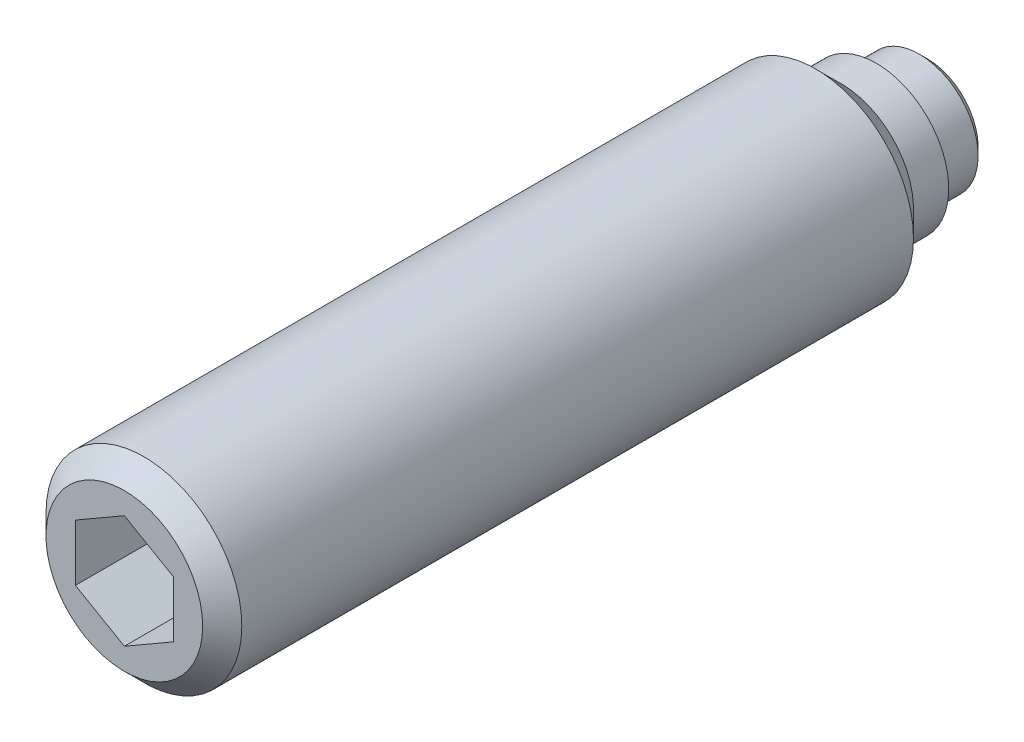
ISO-10303-21;
HEADER;
FILE_DESCRIPTION(('STEP AP214'),'2;1');
FILE_NAME('part.step','',(''),(''),'','','');
FILE_SCHEMA(('AUTOMOTIVE_DESIGN { 1 0 10303 214 1 1 1 1 }'));
ENDSEC;
DATA;
#1=APPLICATION_CONTEXT('core data for automotive mechanical design processes');
#2=APPLICATION_PROTOCOL_DEFINITION('international standard','automotive_design',2000,#1);
#3=PRODUCT_CONTEXT('',#1,'mechanical');
#4=PRODUCT('Part','Part','',(#3));
#5=PRODUCT_RELATED_PRODUCT_CATEGORY('part','',(#4));
#6=PRODUCT_DEFINITION_FORMATION('','',#4);
#7=PRODUCT_DEFINITION_CONTEXT('part definition',#1,'design');
#8=PRODUCT_DEFINITION('design','',#6,#7);
#9=PRODUCT_DEFINITION_SHAPE('','',#8);
#10=(LENGTH_UNIT() NAMED_UNIT(*) SI_UNIT(.MILLI.,.METRE.));
#11=(NAMED_UNIT(*) PLANE_ANGLE_UNIT() SI_UNIT($,.RADIAN.));
#12=(NAMED_UNIT(*) SI_UNIT($,.STERADIAN.) SOLID_ANGLE_UNIT());
#13=UNCERTAINTY_MEASURE_WITH_UNIT(LENGTH_MEASURE(1.E-05),#10,'distance_accuracy_value','');
#14=(GEOMETRIC_REPRESENTATION_CONTEXT(3) GLOBAL_UNCERTAINTY_ASSIGNED_CONTEXT((#13)) GLOBAL_UNIT_ASSIGNED_CONTEXT((#10,
#11,#12)) REPRESENTATION_CONTEXT('',''));
#15=CARTESIAN_POINT('',(0.,0.,0.));
#16=DIRECTION('',(0.,0.,1.));
#17=DIRECTION('',(1.,0.,0.));
#18=AXIS2_PLACEMENT_3D('',#15,#16,#17);
#19=CARTESIAN_POINT('',(0.,0.,1.3));
#20=DIRECTION('',(0.,0.,-1.));
#21=DIRECTION('',(-1.,0.,0.));
#22=AXIS2_PLACEMENT_3D('',#19,#20,#21);
#23=CYLINDRICAL_SURFACE('',#22,2.5);
#24=CARTESIAN_POINT('',(0.,0.,2.85));
#25=DIRECTION('',(0.,0.,-1.));
#26=DIRECTION('',(-1.,0.,0.));
#27=AXIS2_PLACEMENT_3D('',#24,#25,#26);
#28=CIRCLE('',#27,2.5);
#29=CARTESIAN_POINT('',(-2.5,0.,2.85));
#30=VERTEX_POINT('',#29);
#31=EDGE_CURVE('E9',#30,#30,#28,.T.);
#32=ORIENTED_EDGE('',*,*,#31,.F.);
#33=EDGE_LOOP('',(#32));
#34=FACE_BOUND('',#33,.T.);
#35=CARTESIAN_POINT('',(0.,0.,20.));
#36=DIRECTION('',(0.,0.,1.));
#37=DIRECTION('',(1.,0.,0.));
#38=AXIS2_PLACEMENT_3D('',#35,#36,#37);
#39=CIRCLE('',#38,2.5);
#40=CARTESIAN_POINT('',(2.5,0.,20.));
#41=VERTEX_POINT('',#40);
#42=EDGE_CURVE('E115',#41,#41,#39,.T.);
#43=ORIENTED_EDGE('',*,*,#42,.F.);
#44=EDGE_LOOP('',(#43));
#45=FACE_BOUND('',#44,.T.);
#46=ADVANCED_FACE('F14',(#34,#45),#23,.T.);
#47=CARTESIAN_POINT('',(0.,0.,2.85));
#48=DIRECTION('',(0.,0.,1.));
#49=DIRECTION('',(1.,0.,0.));
#50=AXIS2_PLACEMENT_3D('',#47,#48,#49);
#51=CONICAL_SURFACE('',#50,2.5,0.785398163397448);
#52=ORIENTED_EDGE('',*,*,#31,.T.);
#53=EDGE_LOOP('',(#52));
#54=FACE_BOUND('',#53,.T.);
#55=CARTESIAN_POINT('',(0.,0.,2.2));
#56=DIRECTION('',(0.,0.,-1.));
#57=DIRECTION('',(-1.,0.,0.));
#58=AXIS2_PLACEMENT_3D('',#55,#56,#57);
#59=CIRCLE('',#58,1.85);
#60=CARTESIAN_POINT('',(-1.85,0.,2.2));
#61=VERTEX_POINT('',#60);
#62=EDGE_CURVE('E21',#61,#61,#59,.T.);
#63=ORIENTED_EDGE('',*,*,#62,.F.);
#64=EDGE_LOOP('',(#63));
#65=FACE_BOUND('',#64,.T.);
#66=ADVANCED_FACE('F143',(#54,#65),#51,.T.);
#67=CARTESIAN_POINT('',(0.,0.,1.3));
#68=DIRECTION('',(0.,0.,-1.));
#69=DIRECTION('',(-1.,0.,0.));
#70=AXIS2_PLACEMENT_3D('',#67,#68,#69);
#71=CYLINDRICAL_SURFACE('',#70,1.85);
#72=ORIENTED_EDGE('',*,*,#62,.T.);
#73=EDGE_LOOP('',(#72));
#74=FACE_BOUND('',#73,.T.);
#75=CARTESIAN_POINT('',(0.,0.,1.3));
#76=DIRECTION('',(0.,0.,-1.));
#77=DIRECTION('',(-1.,0.,0.));
#78=AXIS2_PLACEMENT_3D('',#75,#76,#77);
#79=CIRCLE('',#78,1.85);
#80=CARTESIAN_POINT('',(-1.85,0.,1.3));
#81=VERTEX_POINT('',#80);
#82=EDGE_CURVE('E135',#81,#81,#79,.T.);
#83=ORIENTED_EDGE('',*,*,#82,.F.);
#84=EDGE_LOOP('',(#83));
#85=FACE_BOUND('',#84,.T.);
#86=ADVANCED_FACE('F140',(#74,#85),#71,.T.);
#87=CARTESIAN_POINT('',(0.,1.85,1.3));
#88=DIRECTION('',(0.,0.,1.));
#89=DIRECTION('',(1.,0.,0.));
#90=AXIS2_PLACEMENT_3D('',#87,#88,#89);
#91=PLANE('',#90);
#92=ORIENTED_EDGE('',*,*,#82,.T.);
#93=EDGE_LOOP('',(#92));
#94=FACE_BOUND('',#93,.T.);
#95=CARTESIAN_POINT('',(0.,0.,1.3));
#96=DIRECTION('',(0.,0.,-1.));
#97=DIRECTION('',(-1.,0.,0.));
#98=AXIS2_PLACEMENT_3D('',#95,#96,#97);
#99=CIRCLE('',#98,1.5);
#100=CARTESIAN_POINT('',(-1.5,0.,1.3));
#101=VERTEX_POINT('',#100);
#102=EDGE_CURVE('E132',#101,#101,#99,.T.);
#103=ORIENTED_EDGE('',*,*,#102,.F.);
#104=EDGE_LOOP('',(#103));
#105=FACE_BOUND('',#104,.T.);
#106=ADVANCED_FACE('F151',(#94,#105),#91,.F.);
#107=CARTESIAN_POINT('',(0.,0.,0.));
#108=DIRECTION('',(0.,0.,-1.));
#109=DIRECTION('',(-1.,0.,0.));
#110=AXIS2_PLACEMENT_3D('',#107,#108,#109);
#111=CYLINDRICAL_SURFACE('',#110,1.5);
#112=CARTESIAN_POINT('',(0.,0.,0.2));
#113=DIRECTION('',(0.,0.,-1.));
#114=DIRECTION('',(-1.,0.,0.));
#115=AXIS2_PLACEMENT_3D('',#112,#113,#114);
#116=CIRCLE('',#115,1.5);
#117=CARTESIAN_POINT('',(-1.5,0.,0.2));
#118=VERTEX_POINT('',#117);
#119=EDGE_CURVE('E129',#118,#118,#116,.T.);
#120=ORIENTED_EDGE('',*,*,#119,.F.);
#121=EDGE_LOOP('',(#120));
#122=FACE_BOUND('',#121,.T.);
#123=ORIENTED_EDGE('',*,*,#102,.T.);
#124=EDGE_LOOP('',(#123));
#125=FACE_BOUND('',#124,.T.);
#126=ADVANCED_FACE('F157',(#122,#125),#111,.T.);
#127=CARTESIAN_POINT('',(0.,0.,0.2));
#128=DIRECTION('',(0.,0.,1.));
#129=DIRECTION('',(1.,0.,0.));
#130=AXIS2_PLACEMENT_3D('',#127,#128,#129);
#131=CONICAL_SURFACE('',#130,1.5,0.785398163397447);
#132=CARTESIAN_POINT('',(0.,0.,0.));
#133=DIRECTION('',(0.,0.,-1.));
#134=DIRECTION('',(-1.,0.,0.));
#135=AXIS2_PLACEMENT_3D('',#132,#133,#134);
#136=CIRCLE('',#135,1.3);
#137=CARTESIAN_POINT('',(-1.3,0.,0.));
#138=VERTEX_POINT('',#137);
#139=EDGE_CURVE('E126',#138,#138,#136,.T.);
#140=ORIENTED_EDGE('',*,*,#139,.F.);
#141=EDGE_LOOP('',(#140));
#142=FACE_BOUND('',#141,.T.);
#143=ORIENTED_EDGE('',*,*,#119,.T.);
#144=EDGE_LOOP('',(#143));
#145=FACE_BOUND('',#144,.T.);
#146=ADVANCED_FACE('F161',(#142,#145),#131,.T.);
#147=CARTESIAN_POINT('',(0.,1.3,0.));
#148=DIRECTION('',(0.,0.,1.));
#149=DIRECTION('',(1.,0.,0.));
#150=AXIS2_PLACEMENT_3D('',#147,#148,#149);
#151=PLANE('',#150);
#152=ORIENTED_EDGE('',*,*,#139,.T.);
#153=EDGE_LOOP('',(#152));
#154=FACE_BOUND('',#153,.T.);
#155=ADVANCED_FACE('F165',(#154),#151,.F.);
#156=CARTESIAN_POINT('',(0.,0.,20.5));
#157=DIRECTION('',(0.,0.,1.));
#158=DIRECTION('',(1.,0.,0.));
#159=AXIS2_PLACEMENT_3D('',#156,#157,#158);
#160=PLANE('',#159);
#161=DIRECTION('',(0.866025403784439,-0.5,0.));
#162=VECTOR('',#161,1.);
#163=CARTESIAN_POINT('',(-1.25,-0.721687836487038,20.5));
#164=LINE('',#163,#162);
#165=CARTESIAN_POINT('',(-1.25,-0.721687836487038,20.5));
#166=VERTEX_POINT('',#165);
#167=CARTESIAN_POINT('',(0.,-1.44337567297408,20.5));
#168=VERTEX_POINT('',#167);
#169=EDGE_CURVE('E28',#166,#168,#164,.T.);
#170=ORIENTED_EDGE('',*,*,#169,.F.);
#171=DIRECTION('',(0.,-1.,0.));
#172=VECTOR('',#171,1.);
#173=CARTESIAN_POINT('',(-1.25,0.721687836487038,20.5));
#174=LINE('',#173,#172);
#175=CARTESIAN_POINT('',(-1.25,0.721687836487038,20.5));
#176=VERTEX_POINT('',#175);
#177=EDGE_CURVE('E111',#176,#166,#174,.T.);
#178=ORIENTED_EDGE('',*,*,#177,.F.);
#179=DIRECTION('',(-0.866025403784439,-0.5,0.));
#180=VECTOR('',#179,1.);
#181=CARTESIAN_POINT('',(0.,1.44337567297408,20.5));
#182=LINE('',#181,#180);
#183=CARTESIAN_POINT('',(0.,1.44337567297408,20.5));
#184=VERTEX_POINT('',#183);
#185=EDGE_CURVE('E109',#184,#176,#182,.T.);
#186=ORIENTED_EDGE('',*,*,#185,.F.);
#187=DIRECTION('',(-0.866025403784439,0.5,0.));
#188=VECTOR('',#187,1.);
#189=CARTESIAN_POINT('',(1.25,0.721687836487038,20.5));
#190=LINE('',#189,#188);
#191=CARTESIAN_POINT('',(1.25,0.721687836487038,20.5));
#192=VERTEX_POINT('',#191);
#193=EDGE_CURVE('E76',#192,#184,#190,.T.);
#194=ORIENTED_EDGE('',*,*,#193,.F.);
#195=DIRECTION('',(0.,1.,0.));
#196=VECTOR('',#195,1.);
#197=CARTESIAN_POINT('',(1.25,-0.721687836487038,20.5));
#198=LINE('',#197,#196);
#199=CARTESIAN_POINT('',(1.25,-0.721687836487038,20.5));
#200=VERTEX_POINT('',#199);
#201=EDGE_CURVE('E105',#200,#192,#198,.T.);
#202=ORIENTED_EDGE('',*,*,#201,.F.);
#203=DIRECTION('',(0.866025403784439,0.5,0.));
#204=VECTOR('',#203,1.);
#205=CARTESIAN_POINT('',(0.,-1.44337567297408,20.5));
#206=LINE('',#205,#204);
#207=EDGE_CURVE('E102',#168,#200,#206,.T.);
#208=ORIENTED_EDGE('',*,*,#207,.F.);
#209=EDGE_LOOP('',(#170,#178,#186,#194,#202,#208));
#210=FACE_BOUND('',#209,.T.);
#211=CARTESIAN_POINT('',(0.,0.,20.5));
#212=DIRECTION('',(0.,0.,1.));
#213=DIRECTION('',(1.,0.,0.));
#214=AXIS2_PLACEMENT_3D('',#211,#212,#213);
#215=CIRCLE('',#214,2.);
#216=CARTESIAN_POINT('',(2.,0.,20.5));
#217=VERTEX_POINT('',#216);
#218=EDGE_CURVE('E123',#217,#217,#215,.T.);
#219=ORIENTED_EDGE('',*,*,#218,.T.);
#220=EDGE_LOOP('',(#219));
#221=FACE_BOUND('',#220,.T.);
#222=ADVANCED_FACE('F169',(#210,#221),#160,.T.);
#223=CARTESIAN_POINT('',(0.,0.,20.5));
#224=DIRECTION('',(0.,0.,-1.));
#225=DIRECTION('',(-1.,0.,0.));
#226=AXIS2_PLACEMENT_3D('',#223,#224,#225);
#227=CONICAL_SURFACE('',#226,2.,0.785398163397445);
#228=ORIENTED_EDGE('',*,*,#42,.T.);
#229=EDGE_LOOP('',(#228));
#230=FACE_BOUND('',#229,.T.);
#231=ORIENTED_EDGE('',*,*,#218,.F.);
#232=EDGE_LOOP('',(#231));
#233=FACE_BOUND('',#232,.T.);
#234=ADVANCED_FACE('F173',(#230,#233),#227,.T.);
#235=CARTESIAN_POINT('',(-1.25,-0.721687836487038,17.5));
#236=DIRECTION('',(-0.5,-0.866025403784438,0.));
#237=DIRECTION('',(0.866025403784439,-0.5,0.));
#238=AXIS2_PLACEMENT_3D('',#235,#236,#237);
#239=PLANE('',#238);
#240=ORIENTED_EDGE('',*,*,#169,.T.);
#241=DIRECTION('',(0.,0.,1.));
#242=VECTOR('',#241,1.);
#243=CARTESIAN_POINT('',(0.,-1.44337567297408,17.5));
#244=LINE('',#243,#242);
#245=CARTESIAN_POINT('',(0.,-1.44337567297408,17.5));
#246=VERTEX_POINT('',#245);
#247=EDGE_CURVE('E58',#246,#168,#244,.T.);
#248=ORIENTED_EDGE('',*,*,#247,.F.);
#249=DIRECTION('',(0.866025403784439,-0.5,0.));
#250=VECTOR('',#249,1.);
#251=CARTESIAN_POINT('',(-1.25,-0.721687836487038,17.5));
#252=LINE('',#251,#250);
#253=CARTESIAN_POINT('',(-1.25,-0.721687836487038,17.5));
#254=VERTEX_POINT('',#253);
#255=EDGE_CURVE('E113',#254,#246,#252,.T.);
#256=ORIENTED_EDGE('',*,*,#255,.F.);
#257=DIRECTION('',(0.,0.,1.));
#258=VECTOR('',#257,1.);
#259=CARTESIAN_POINT('',(-1.25,-0.721687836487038,17.5));
#260=LINE('',#259,#258);
#261=EDGE_CURVE('E36',#254,#166,#260,.T.);
#262=ORIENTED_EDGE('',*,*,#261,.T.);
#263=EDGE_LOOP('',(#240,#248,#256,#262));
#264=FACE_BOUND('',#263,.T.);
#265=ADVANCED_FACE('F177',(#264),#239,.F.);
#266=CARTESIAN_POINT('',(-1.25,0.721687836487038,17.5));
#267=DIRECTION('',(-1.,0.,0.));
#268=DIRECTION('',(0.,0.,1.));
#269=AXIS2_PLACEMENT_3D('',#266,#267,#268);
#270=PLANE('',#269);
#271=ORIENTED_EDGE('',*,*,#177,.T.);
#272=ORIENTED_EDGE('',*,*,#261,.F.);
#273=DIRECTION('',(0.,-1.,0.));
#274=VECTOR('',#273,1.);
#275=CARTESIAN_POINT('',(-1.25,0.721687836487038,17.5));
#276=LINE('',#275,#274);
#277=CARTESIAN_POINT('',(-1.25,0.721687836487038,17.5));
#278=VERTEX_POINT('',#277);
#279=EDGE_CURVE('E88',#278,#254,#276,.T.);
#280=ORIENTED_EDGE('',*,*,#279,.F.);
#281=DIRECTION('',(0.,0.,1.));
#282=VECTOR('',#281,1.);
#283=CARTESIAN_POINT('',(-1.25,0.721687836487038,17.5));
#284=LINE('',#283,#282);
#285=EDGE_CURVE('E80',#278,#176,#284,.T.);
#286=ORIENTED_EDGE('',*,*,#285,.T.);
#287=EDGE_LOOP('',(#271,#272,#280,#286));
#288=FACE_BOUND('',#287,.T.);
#289=ADVANCED_FACE('F181',(#288),#270,.F.);
#290=CARTESIAN_POINT('',(0.,1.44337567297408,17.5));
#291=DIRECTION('',(-0.5,0.866025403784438,0.));
#292=DIRECTION('',(-0.866025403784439,-0.5,0.));
#293=AXIS2_PLACEMENT_3D('',#290,#291,#292);
#294=PLANE('',#293);
#295=ORIENTED_EDGE('',*,*,#185,.T.);
#296=ORIENTED_EDGE('',*,*,#285,.F.);
#297=DIRECTION('',(-0.866025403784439,-0.5,0.));
#298=VECTOR('',#297,1.);
#299=CARTESIAN_POINT('',(0.,1.44337567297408,17.5));
#300=LINE('',#299,#298);
#301=CARTESIAN_POINT('',(0.,1.44337567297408,17.5));
#302=VERTEX_POINT('',#301);
#303=EDGE_CURVE('E84',#302,#278,#300,.T.);
#304=ORIENTED_EDGE('',*,*,#303,.F.);
#305=DIRECTION('',(0.,0.,1.));
#306=VECTOR('',#305,1.);
#307=CARTESIAN_POINT('',(0.,1.44337567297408,17.5));
#308=LINE('',#307,#306);
#309=EDGE_CURVE('E69',#302,#184,#308,.T.);
#310=ORIENTED_EDGE('',*,*,#309,.T.);
#311=EDGE_LOOP('',(#295,#296,#304,#310));
#312=FACE_BOUND('',#311,.T.);
#313=ADVANCED_FACE('F85',(#312),#294,.F.);
#314=CARTESIAN_POINT('',(1.25,0.721687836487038,17.5));
#315=DIRECTION('',(0.5,0.866025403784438,0.));
#316=DIRECTION('',(-0.866025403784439,0.5,0.));
#317=AXIS2_PLACEMENT_3D('',#314,#315,#316);
#318=PLANE('',#317);
#319=ORIENTED_EDGE('',*,*,#193,.T.);
#320=ORIENTED_EDGE('',*,*,#309,.F.);
#321=DIRECTION('',(-0.866025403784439,0.5,0.));
#322=VECTOR('',#321,1.);
#323=CARTESIAN_POINT('',(1.25,0.721687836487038,17.5));
#324=LINE('',#323,#322);
#325=CARTESIAN_POINT('',(1.25,0.721687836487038,17.5));
#326=VERTEX_POINT('',#325);
#327=EDGE_CURVE('E73',#326,#302,#324,.T.);
#328=ORIENTED_EDGE('',*,*,#327,.F.);
#329=DIRECTION('',(0.,0.,1.));
#330=VECTOR('',#329,1.);
#331=CARTESIAN_POINT('',(1.25,0.721687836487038,17.5));
#332=LINE('',#331,#330);
#333=EDGE_CURVE('E81',#326,#192,#332,.T.);
#334=ORIENTED_EDGE('',*,*,#333,.T.);
#335=EDGE_LOOP('',(#319,#320,#328,#334));
#336=FACE_BOUND('',#335,.T.);
#337=ADVANCED_FACE('F71',(#336),#318,.F.);
#338=CARTESIAN_POINT('',(1.25,-0.721687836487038,17.5));
#339=DIRECTION('',(1.,0.,0.));
#340=DIRECTION('',(0.,0.,-1.));
#341=AXIS2_PLACEMENT_3D('',#338,#339,#340);
#342=PLANE('',#341);
#343=ORIENTED_EDGE('',*,*,#201,.T.);
#344=ORIENTED_EDGE('',*,*,#333,.F.);
#345=DIRECTION('',(0.,1.,0.));
#346=VECTOR('',#345,1.);
#347=CARTESIAN_POINT('',(1.25,-0.721687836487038,17.5));
#348=LINE('',#347,#346);
#349=CARTESIAN_POINT('',(1.25,-0.721687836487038,17.5));
#350=VERTEX_POINT('',#349);
#351=EDGE_CURVE('E94',#350,#326,#348,.T.);
#352=ORIENTED_EDGE('',*,*,#351,.F.);
#353=DIRECTION('',(0.,0.,1.));
#354=VECTOR('',#353,1.);
#355=CARTESIAN_POINT('',(1.25,-0.721687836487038,17.5));
#356=LINE('',#355,#354);
#357=EDGE_CURVE('E118',#350,#200,#356,.T.);
#358=ORIENTED_EDGE('',*,*,#357,.T.);
#359=EDGE_LOOP('',(#343,#344,#352,#358));
#360=FACE_BOUND('',#359,.T.);
#361=ADVANCED_FACE('F185',(#360),#342,.F.);
#362=CARTESIAN_POINT('',(0.,-1.44337567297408,17.5));
#363=DIRECTION('',(0.5,-0.866025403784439,0.));
#364=DIRECTION('',(0.866025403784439,0.5,0.));
#365=AXIS2_PLACEMENT_3D('',#362,#363,#364);
#366=PLANE('',#365);
#367=ORIENTED_EDGE('',*,*,#207,.T.);
#368=ORIENTED_EDGE('',*,*,#357,.F.);
#369=DIRECTION('',(0.866025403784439,0.5,0.));
#370=VECTOR('',#369,1.);
#371=CARTESIAN_POINT('',(0.,-1.44337567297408,17.5));
#372=LINE('',#371,#370);
#373=EDGE_CURVE('E96',#246,#350,#372,.T.);
#374=ORIENTED_EDGE('',*,*,#373,.F.);
#375=ORIENTED_EDGE('',*,*,#247,.T.);
#376=EDGE_LOOP('',(#367,#368,#374,#375));
#377=FACE_BOUND('',#376,.T.);
#378=ADVANCED_FACE('F182',(#377),#366,.F.);
#379=CARTESIAN_POINT('',(0.,0.,17.5));
#380=DIRECTION('',(0.,0.,1.));
#381=DIRECTION('',(1.,0.,0.));
#382=AXIS2_PLACEMENT_3D('',#379,#380,#381);
#383=PLANE('',#382);
#384=ORIENTED_EDGE('',*,*,#255,.T.);
#385=ORIENTED_EDGE('',*,*,#373,.T.);
#386=ORIENTED_EDGE('',*,*,#351,.T.);
#387=ORIENTED_EDGE('',*,*,#327,.T.);
#388=ORIENTED_EDGE('',*,*,#303,.T.);
#389=ORIENTED_EDGE('',*,*,#279,.T.);
#390=EDGE_LOOP('',(#384,#385,#386,#387,#388,#389));
#391=FACE_BOUND('',#390,.T.);
#392=ADVANCED_FACE('F91',(#391),#383,.T.);
#393=CLOSED_SHELL('',(#46,#66,#86,#106,#126,#146,#155,#222,#234,#265,#289,#313,#337,#361,#378,#392));
#394=MANIFOLD_SOLID_BREP('B1',#393);
#395=ADVANCED_BREP_SHAPE_REPRESENTATION('',(#18,#394),#14);
#396=SHAPE_DEFINITION_REPRESENTATION(#9,#395);
ENDSEC;
END-ISO-10303-21;
